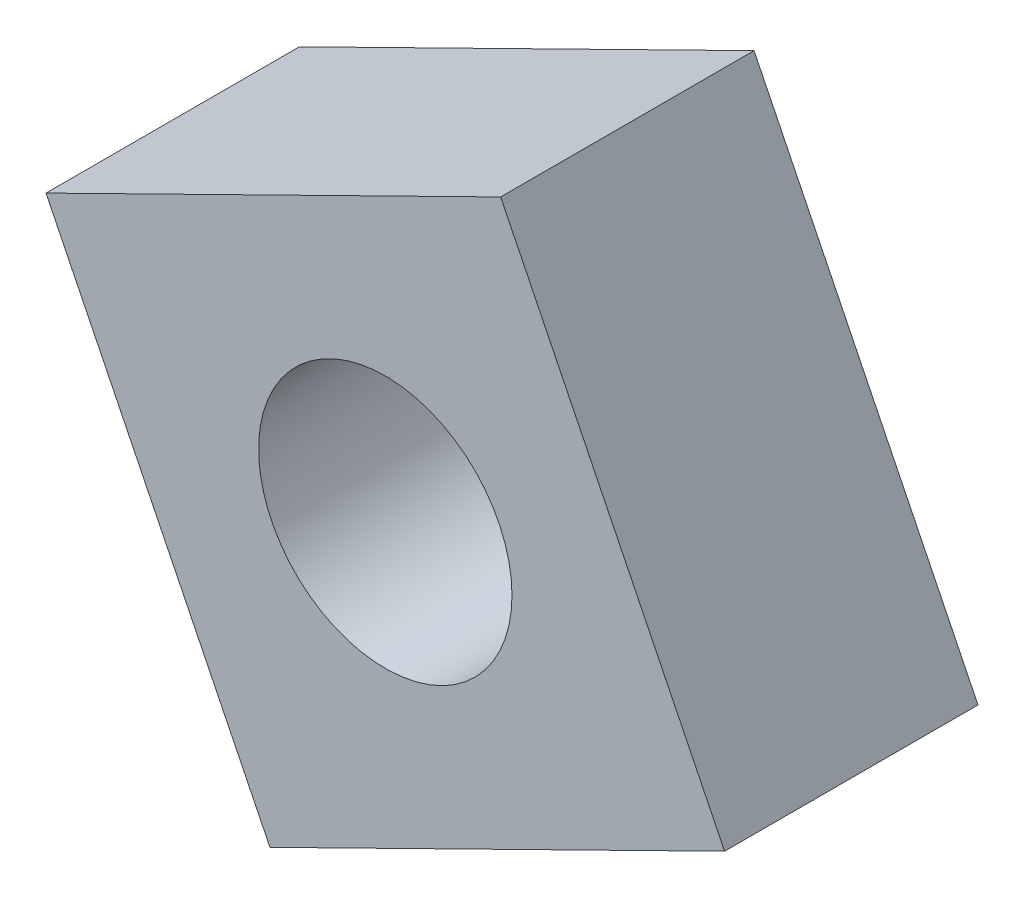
ISO-10303-21;
HEADER;
FILE_DESCRIPTION(('STEP AP214'),'2;1');
FILE_NAME('part.step','',(''),(''),'','','');
FILE_SCHEMA(('AUTOMOTIVE_DESIGN { 1 0 10303 214 1 1 1 1 }'));
ENDSEC;
DATA;
#1=APPLICATION_CONTEXT('core data for automotive mechanical design processes');
#2=APPLICATION_PROTOCOL_DEFINITION('international standard','automotive_design',2000,#1);
#3=PRODUCT_CONTEXT('',#1,'mechanical');
#4=PRODUCT('Part','Part','',(#3));
#5=PRODUCT_RELATED_PRODUCT_CATEGORY('part','',(#4));
#6=PRODUCT_DEFINITION_FORMATION('','',#4);
#7=PRODUCT_DEFINITION_CONTEXT('part definition',#1,'design');
#8=PRODUCT_DEFINITION('design','',#6,#7);
#9=PRODUCT_DEFINITION_SHAPE('','',#8);
#10=(LENGTH_UNIT() NAMED_UNIT(*) SI_UNIT(.MILLI.,.METRE.));
#11=(NAMED_UNIT(*) PLANE_ANGLE_UNIT() SI_UNIT($,.RADIAN.));
#12=(NAMED_UNIT(*) SI_UNIT($,.STERADIAN.) SOLID_ANGLE_UNIT());
#13=UNCERTAINTY_MEASURE_WITH_UNIT(LENGTH_MEASURE(1.E-05),#10,'distance_accuracy_value','');
#14=(GEOMETRIC_REPRESENTATION_CONTEXT(3) GLOBAL_UNCERTAINTY_ASSIGNED_CONTEXT((#13)) GLOBAL_UNIT_ASSIGNED_CONTEXT((#10,
#11,#12)) REPRESENTATION_CONTEXT('',''));
#15=CARTESIAN_POINT('',(0.,0.,0.));
#16=DIRECTION('',(0.,0.,1.));
#17=DIRECTION('',(1.,0.,0.));
#18=AXIS2_PLACEMENT_3D('',#15,#16,#17);
#19=CARTESIAN_POINT('',(0.,0.,2.));
#20=DIRECTION('',(0.,0.,1.));
#21=DIRECTION('',(1.,0.,0.));
#22=AXIS2_PLACEMENT_3D('',#19,#20,#21);
#23=PLANE('',#22);
#24=DIRECTION('',(-0.897067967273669,-0.441892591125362,0.));
#25=VECTOR('',#24,1.);
#26=CARTESIAN_POINT('',(-2.67792111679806,0.910350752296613,2.));
#27=LINE('',#26,#25);
#28=CARTESIAN_POINT('',(0.910350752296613,2.67792111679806,2.));
#29=VERTEX_POINT('',#28);
#30=CARTESIAN_POINT('',(-2.67792111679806,0.910350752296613,2.));
#31=VERTEX_POINT('',#30);
#32=EDGE_CURVE('E85',#29,#31,#27,.T.);
#33=ORIENTED_EDGE('',*,*,#32,.T.);
#34=DIRECTION('',(0.441892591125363,-0.897067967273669,0.));
#35=VECTOR('',#34,1.);
#36=CARTESIAN_POINT('',(-2.67792111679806,0.910350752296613,2.));
#37=LINE('',#36,#35);
#38=CARTESIAN_POINT('',(-0.910350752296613,-2.67792111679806,2.));
#39=VERTEX_POINT('',#38);
#40=EDGE_CURVE('E80',#31,#39,#37,.T.);
#41=ORIENTED_EDGE('',*,*,#40,.T.);
#42=DIRECTION('',(0.897067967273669,0.441892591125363,0.));
#43=VECTOR('',#42,1.);
#44=CARTESIAN_POINT('',(-0.910350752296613,-2.67792111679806,2.));
#45=LINE('',#44,#43);
#46=CARTESIAN_POINT('',(2.67792111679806,-0.910350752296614,2.));
#47=VERTEX_POINT('',#46);
#48=EDGE_CURVE('E83',#39,#47,#45,.T.);
#49=ORIENTED_EDGE('',*,*,#48,.T.);
#50=DIRECTION('',(-0.441892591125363,0.897067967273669,0.));
#51=VECTOR('',#50,1.);
#52=CARTESIAN_POINT('',(2.67792111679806,-0.910350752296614,2.));
#53=LINE('',#52,#51);
#54=EDGE_CURVE('E50',#47,#29,#53,.T.);
#55=ORIENTED_EDGE('',*,*,#54,.T.);
#56=EDGE_LOOP('',(#33,#41,#49,#55));
#57=FACE_BOUND('',#56,.T.);
#58=CARTESIAN_POINT('',(0.,0.,2.));
#59=DIRECTION('',(0.,0.,1.));
#60=DIRECTION('',(1.,0.,0.));
#61=AXIS2_PLACEMENT_3D('',#58,#59,#60);
#62=CIRCLE('',#61,1.);
#63=CARTESIAN_POINT('',(1.,0.,2.));
#64=VERTEX_POINT('',#63);
#65=EDGE_CURVE('E100',#64,#64,#62,.T.);
#66=ORIENTED_EDGE('',*,*,#65,.F.);
#67=EDGE_LOOP('',(#66));
#68=FACE_BOUND('',#67,.T.);
#69=ADVANCED_FACE('F33',(#57,#68),#23,.T.);
#70=CARTESIAN_POINT('',(0.,0.,0.));
#71=DIRECTION('',(0.,0.,1.));
#72=DIRECTION('',(1.,0.,0.));
#73=AXIS2_PLACEMENT_3D('',#70,#71,#72);
#74=PLANE('',#73);
#75=DIRECTION('',(-0.897067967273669,-0.441892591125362,0.));
#76=VECTOR('',#75,1.);
#77=CARTESIAN_POINT('',(-2.67792111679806,0.910350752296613,0.));
#78=LINE('',#77,#76);
#79=CARTESIAN_POINT('',(0.910350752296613,2.67792111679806,0.));
#80=VERTEX_POINT('',#79);
#81=CARTESIAN_POINT('',(-2.67792111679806,0.910350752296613,0.));
#82=VERTEX_POINT('',#81);
#83=EDGE_CURVE('E97',#80,#82,#78,.T.);
#84=ORIENTED_EDGE('',*,*,#83,.F.);
#85=DIRECTION('',(-0.441892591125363,0.897067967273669,0.));
#86=VECTOR('',#85,1.);
#87=CARTESIAN_POINT('',(2.67792111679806,-0.910350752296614,0.));
#88=LINE('',#87,#86);
#89=CARTESIAN_POINT('',(2.67792111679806,-0.910350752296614,0.));
#90=VERTEX_POINT('',#89);
#91=EDGE_CURVE('E73',#90,#80,#88,.T.);
#92=ORIENTED_EDGE('',*,*,#91,.F.);
#93=DIRECTION('',(0.897067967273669,0.441892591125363,0.));
#94=VECTOR('',#93,1.);
#95=CARTESIAN_POINT('',(-0.910350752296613,-2.67792111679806,0.));
#96=LINE('',#95,#94);
#97=CARTESIAN_POINT('',(-0.910350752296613,-2.67792111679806,0.));
#98=VERTEX_POINT('',#97);
#99=EDGE_CURVE('E67',#98,#90,#96,.T.);
#100=ORIENTED_EDGE('',*,*,#99,.F.);
#101=DIRECTION('',(0.441892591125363,-0.897067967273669,0.));
#102=VECTOR('',#101,1.);
#103=CARTESIAN_POINT('',(-2.67792111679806,0.910350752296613,0.));
#104=LINE('',#103,#102);
#105=EDGE_CURVE('E89',#82,#98,#104,.T.);
#106=ORIENTED_EDGE('',*,*,#105,.F.);
#107=EDGE_LOOP('',(#84,#92,#100,#106));
#108=FACE_BOUND('',#107,.T.);
#109=CARTESIAN_POINT('',(0.,0.,0.));
#110=DIRECTION('',(0.,0.,1.));
#111=DIRECTION('',(1.,0.,0.));
#112=AXIS2_PLACEMENT_3D('',#109,#110,#111);
#113=CIRCLE('',#112,1.);
#114=CARTESIAN_POINT('',(1.,0.,0.));
#115=VERTEX_POINT('',#114);
#116=EDGE_CURVE('E112',#115,#115,#113,.T.);
#117=ORIENTED_EDGE('',*,*,#116,.T.);
#118=EDGE_LOOP('',(#117));
#119=FACE_BOUND('',#118,.T.);
#120=ADVANCED_FACE('F108',(#108,#119),#74,.F.);
#121=CARTESIAN_POINT('',(-2.67792111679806,0.910350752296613,2.));
#122=DIRECTION('',(0.441892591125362,-0.897067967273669,0.));
#123=DIRECTION('',(0.89706796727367,0.441892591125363,0.));
#124=AXIS2_PLACEMENT_3D('',#121,#122,#123);
#125=PLANE('',#124);
#126=ORIENTED_EDGE('',*,*,#83,.T.);
#127=DIRECTION('',(0.,0.,-1.));
#128=VECTOR('',#127,1.);
#129=CARTESIAN_POINT('',(-2.67792111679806,0.910350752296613,2.));
#130=LINE('',#129,#128);
#131=EDGE_CURVE('E11',#31,#82,#130,.T.);
#132=ORIENTED_EDGE('',*,*,#131,.F.);
#133=ORIENTED_EDGE('',*,*,#32,.F.);
#134=DIRECTION('',(0.,0.,-1.));
#135=VECTOR('',#134,1.);
#136=CARTESIAN_POINT('',(0.910350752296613,2.67792111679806,2.));
#137=LINE('',#136,#135);
#138=EDGE_CURVE('E93',#29,#80,#137,.T.);
#139=ORIENTED_EDGE('',*,*,#138,.T.);
#140=EDGE_LOOP('',(#126,#132,#133,#139));
#141=FACE_BOUND('',#140,.T.);
#142=ADVANCED_FACE('F35',(#141),#125,.F.);
#143=CARTESIAN_POINT('',(-2.67792111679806,0.910350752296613,2.));
#144=DIRECTION('',(0.897067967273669,0.441892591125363,0.));
#145=DIRECTION('',(-0.441892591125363,0.897067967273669,0.));
#146=AXIS2_PLACEMENT_3D('',#143,#144,#145);
#147=PLANE('',#146);
#148=ORIENTED_EDGE('',*,*,#105,.T.);
#149=DIRECTION('',(0.,0.,-1.));
#150=VECTOR('',#149,1.);
#151=CARTESIAN_POINT('',(-0.910350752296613,-2.67792111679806,2.));
#152=LINE('',#151,#150);
#153=EDGE_CURVE('E42',#39,#98,#152,.T.);
#154=ORIENTED_EDGE('',*,*,#153,.F.);
#155=ORIENTED_EDGE('',*,*,#40,.F.);
#156=ORIENTED_EDGE('',*,*,#131,.T.);
#157=EDGE_LOOP('',(#148,#154,#155,#156));
#158=FACE_BOUND('',#157,.T.);
#159=ADVANCED_FACE('F88',(#158),#147,.F.);
#160=CARTESIAN_POINT('',(-0.910350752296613,-2.67792111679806,2.));
#161=DIRECTION('',(-0.441892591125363,0.897067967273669,0.));
#162=DIRECTION('',(-0.897067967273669,-0.441892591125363,0.));
#163=AXIS2_PLACEMENT_3D('',#160,#161,#162);
#164=PLANE('',#163);
#165=ORIENTED_EDGE('',*,*,#99,.T.);
#166=DIRECTION('',(0.,0.,-1.));
#167=VECTOR('',#166,1.);
#168=CARTESIAN_POINT('',(2.67792111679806,-0.910350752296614,2.));
#169=LINE('',#168,#167);
#170=EDGE_CURVE('E90',#47,#90,#169,.T.);
#171=ORIENTED_EDGE('',*,*,#170,.F.);
#172=ORIENTED_EDGE('',*,*,#48,.F.);
#173=ORIENTED_EDGE('',*,*,#153,.T.);
#174=EDGE_LOOP('',(#165,#171,#172,#173));
#175=FACE_BOUND('',#174,.T.);
#176=ADVANCED_FACE('F91',(#175),#164,.F.);
#177=CARTESIAN_POINT('',(2.67792111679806,-0.910350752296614,2.));
#178=DIRECTION('',(-0.897067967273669,-0.441892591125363,0.));
#179=DIRECTION('',(0.441892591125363,-0.897067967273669,0.));
#180=AXIS2_PLACEMENT_3D('',#177,#178,#179);
#181=PLANE('',#180);
#182=ORIENTED_EDGE('',*,*,#91,.T.);
#183=ORIENTED_EDGE('',*,*,#138,.F.);
#184=ORIENTED_EDGE('',*,*,#54,.F.);
#185=ORIENTED_EDGE('',*,*,#170,.T.);
#186=EDGE_LOOP('',(#182,#183,#184,#185));
#187=FACE_BOUND('',#186,.T.);
#188=ADVANCED_FACE('F105',(#187),#181,.F.);
#189=CARTESIAN_POINT('',(0.,0.,2.));
#190=DIRECTION('',(0.,0.,-1.));
#191=DIRECTION('',(-1.,0.,0.));
#192=AXIS2_PLACEMENT_3D('',#189,#190,#191);
#193=CYLINDRICAL_SURFACE('',#192,1.);
#194=ORIENTED_EDGE('',*,*,#65,.T.);
#195=EDGE_LOOP('',(#194));
#196=FACE_BOUND('',#195,.T.);
#197=ORIENTED_EDGE('',*,*,#116,.F.);
#198=EDGE_LOOP('',(#197));
#199=FACE_BOUND('',#198,.T.);
#200=ADVANCED_FACE('F118',(#196,#199),#193,.F.);
#201=CLOSED_SHELL('',(#69,#120,#142,#159,#176,#188,#200));
#202=MANIFOLD_SOLID_BREP('B2',#201);
#203=ADVANCED_BREP_SHAPE_REPRESENTATION('',(#18,#202),#14);
#204=SHAPE_DEFINITION_REPRESENTATION(#9,#203);
ENDSEC;
END-ISO-10303-21;
